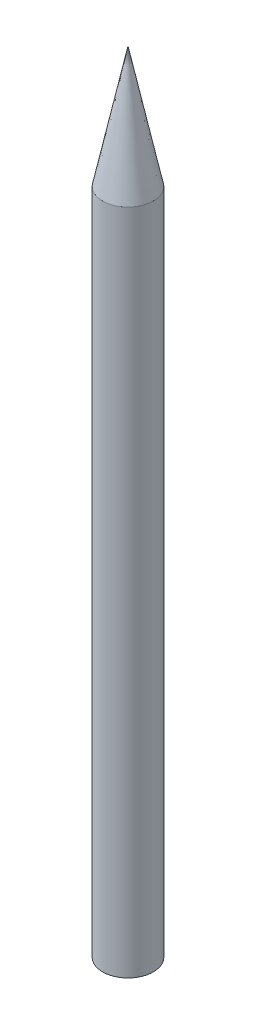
ISO-10303-21;
HEADER;
FILE_DESCRIPTION(('STEP AP214'),'2;1');
FILE_NAME('part.step','',(''),(''),'','','');
FILE_SCHEMA(('AUTOMOTIVE_DESIGN { 1 0 10303 214 1 1 1 1 }'));
ENDSEC;
DATA;
#1=APPLICATION_CONTEXT('core data for automotive mechanical design processes');
#2=APPLICATION_PROTOCOL_DEFINITION('international standard','automotive_design',2000,#1);
#3=PRODUCT_CONTEXT('',#1,'mechanical');
#4=PRODUCT('Part','Part','',(#3));
#5=PRODUCT_RELATED_PRODUCT_CATEGORY('part','',(#4));
#6=PRODUCT_DEFINITION_FORMATION('','',#4);
#7=PRODUCT_DEFINITION_CONTEXT('part definition',#1,'design');
#8=PRODUCT_DEFINITION('design','',#6,#7);
#9=PRODUCT_DEFINITION_SHAPE('','',#8);
#10=(LENGTH_UNIT() NAMED_UNIT(*) SI_UNIT(.MILLI.,.METRE.));
#11=(NAMED_UNIT(*) PLANE_ANGLE_UNIT() SI_UNIT($,.RADIAN.));
#12=(NAMED_UNIT(*) SI_UNIT($,.STERADIAN.) SOLID_ANGLE_UNIT());
#13=UNCERTAINTY_MEASURE_WITH_UNIT(LENGTH_MEASURE(1.E-05),#10,'distance_accuracy_value','');
#14=(GEOMETRIC_REPRESENTATION_CONTEXT(3) GLOBAL_UNCERTAINTY_ASSIGNED_CONTEXT((#13)) GLOBAL_UNIT_ASSIGNED_CONTEXT((#10,
#11,#12)) REPRESENTATION_CONTEXT('',''));
#15=CARTESIAN_POINT('',(0.,0.,0.));
#16=DIRECTION('',(0.,0.,1.));
#17=DIRECTION('',(1.,0.,0.));
#18=AXIS2_PLACEMENT_3D('',#15,#16,#17);
#19=CARTESIAN_POINT('',(0.,139.741936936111,0.));
#20=DIRECTION('',(0.,-1.,0.));
#21=DIRECTION('',(0.,0.,-1.));
#22=AXIS2_PLACEMENT_3D('',#19,#20,#21);
#23=CONICAL_SURFACE('',#22,0.,1.56288386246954);
#24=CARTESIAN_POINT('',(0.,139.7,0.));
#25=DIRECTION('',(0.,-1.,0.));
#26=DIRECTION('',(0.,0.,-1.));
#27=AXIS2_PLACEMENT_3D('',#24,#25,#26);
#28=CIRCLE('',#27,5.3);
#29=CARTESIAN_POINT('',(0.,139.7,-5.3));
#30=VERTEX_POINT('',#29);
#31=EDGE_CURVE('E12',#30,#30,#28,.T.);
#32=ORIENTED_EDGE('',*,*,#31,.T.);
#33=EDGE_LOOP('',(#32));
#34=FACE_BOUND('',#33,.T.);
#35=CARTESIAN_POINT('',(0.,139.741936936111,0.));
#36=VERTEX_POINT('',#35);
#37=VERTEX_LOOP('',#36);
#38=FACE_BOUND('',#37,.T.);
#39=ADVANCED_FACE('F47',(#34,#38),#23,.F.);
#40=CARTESIAN_POINT('',(0.,139.7,0.));
#41=DIRECTION('',(0.,-1.,0.));
#42=DIRECTION('',(0.,0.,-1.));
#43=AXIS2_PLACEMENT_3D('',#40,#41,#42);
#44=CONICAL_SURFACE('',#43,5.3,0.205380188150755);
#45=CARTESIAN_POINT('',(0.,165.141936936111,0.));
#46=VERTEX_POINT('',#45);
#47=VERTEX_LOOP('',#46);
#48=FACE_BOUND('',#47,.T.);
#49=ORIENTED_EDGE('',*,*,#31,.F.);
#50=EDGE_LOOP('',(#49));
#51=FACE_BOUND('',#50,.T.);
#52=ADVANCED_FACE('F59',(#48,#51),#44,.T.);
#53=CLOSED_SHELL('',(#39,#52));
#54=MANIFOLD_SOLID_BREP('B2',#53);
#55=CARTESIAN_POINT('',(0.,139.7,0.));
#56=DIRECTION('',(0.,-1.,0.));
#57=DIRECTION('',(0.,0.,-1.));
#58=AXIS2_PLACEMENT_3D('',#55,#56,#57);
#59=CYLINDRICAL_SURFACE('',#58,5.3);
#60=CARTESIAN_POINT('',(0.,139.7,0.));
#61=DIRECTION('',(0.,1.,0.));
#62=DIRECTION('',(0.,0.,1.));
#63=AXIS2_PLACEMENT_3D('',#60,#61,#62);
#64=CIRCLE('',#63,5.3);
#65=CARTESIAN_POINT('',(0.,139.7,5.3));
#66=VERTEX_POINT('',#65);
#67=EDGE_CURVE('E46',#66,#66,#64,.T.);
#68=ORIENTED_EDGE('',*,*,#67,.F.);
#69=EDGE_LOOP('',(#68));
#70=FACE_BOUND('',#69,.T.);
#71=CARTESIAN_POINT('',(0.,0.,0.));
#72=DIRECTION('',(0.,1.,0.));
#73=DIRECTION('',(0.,0.,1.));
#74=AXIS2_PLACEMENT_3D('',#71,#72,#73);
#75=CIRCLE('',#74,5.3);
#76=CARTESIAN_POINT('',(0.,0.,5.3));
#77=VERTEX_POINT('',#76);
#78=EDGE_CURVE('E82',#77,#77,#75,.T.);
#79=ORIENTED_EDGE('',*,*,#78,.T.);
#80=EDGE_LOOP('',(#79));
#81=FACE_BOUND('',#80,.T.);
#82=ADVANCED_FACE('F79',(#70,#81),#59,.T.);
#83=CARTESIAN_POINT('',(0.,139.7,0.));
#84=DIRECTION('',(0.,1.,0.));
#85=DIRECTION('',(0.,0.,1.));
#86=AXIS2_PLACEMENT_3D('',#83,#84,#85);
#87=PLANE('',#86);
#88=ORIENTED_EDGE('',*,*,#67,.T.);
#89=EDGE_LOOP('',(#88));
#90=FACE_BOUND('',#89,.T.);
#91=ADVANCED_FACE('F96',(#90),#87,.T.);
#92=CARTESIAN_POINT('',(0.,0.,0.));
#93=DIRECTION('',(0.,1.,0.));
#94=DIRECTION('',(0.,0.,1.));
#95=AXIS2_PLACEMENT_3D('',#92,#93,#94);
#96=PLANE('',#95);
#97=ORIENTED_EDGE('',*,*,#78,.F.);
#98=EDGE_LOOP('',(#97));
#99=FACE_BOUND('',#98,.T.);
#100=ADVANCED_FACE('F94',(#99),#96,.F.);
#101=CLOSED_SHELL('',(#82,#91,#100));
#102=MANIFOLD_SOLID_BREP('B6',#101);
#103=ADVANCED_BREP_SHAPE_REPRESENTATION('',(#18,#54,#102),#14);
#104=SHAPE_DEFINITION_REPRESENTATION(#9,#103);
ENDSEC;
END-ISO-10303-21;
